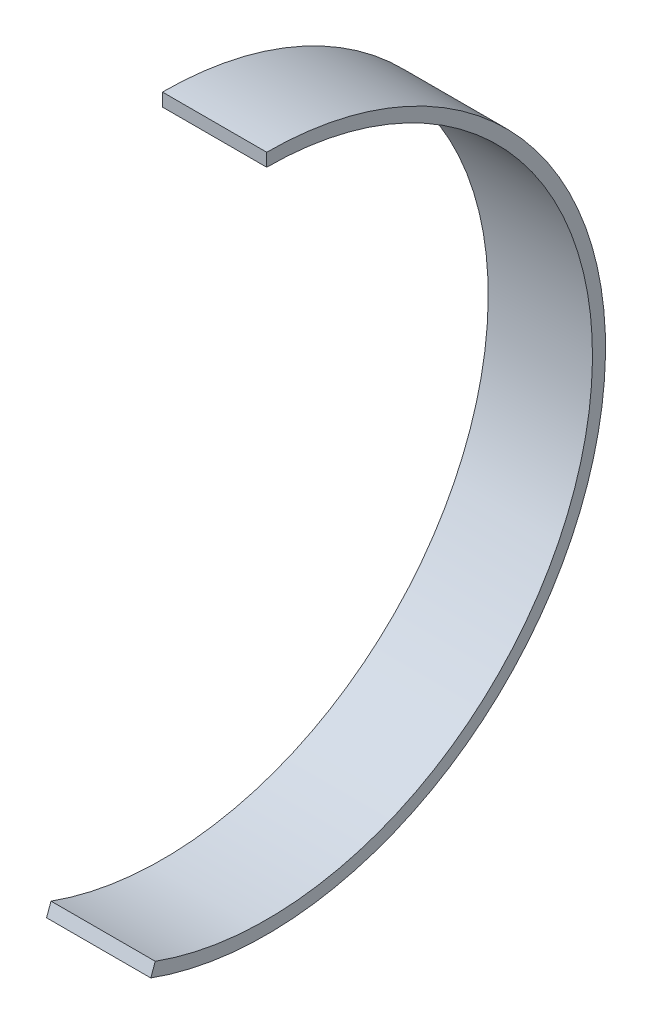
from build123d import *

# Parameters (mm, degrees)
ESQUISSE1_W       = 4
ESQUISSE1_H       = 0.5
R_VOLUTION1_ANGLE = 200


with BuildPart() as part:
    # Esquisse1 → R_volution1 (revolve)
    with BuildSketch(Plane.XY):
        with Locations((0, 12.75)):
            Rectangle(ESQUISSE1_W, ESQUISSE1_H)
    revolve(axis=Axis((0, 0, 0), (-1, 0, 0)), revolution_arc=R_VOLUTION1_ANGLE)


solid = part.part
